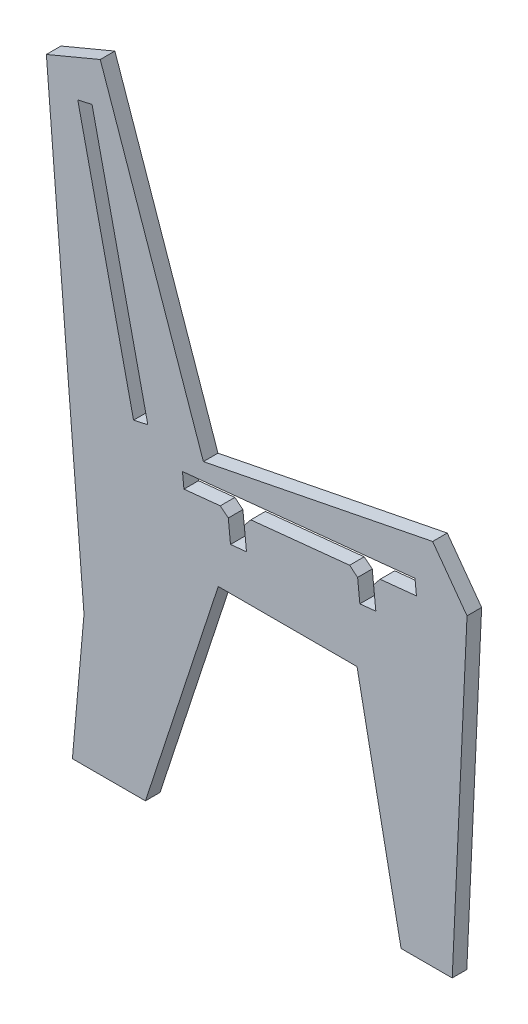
from build123d import *

# Parameters (mm, degrees)
BOSS_EXTRU_1_DEPTH      = 20
ENL_V_MAT_EXTRU_1_REACH = 1007.791
CHANFREIN1_SIZE         = 10


with BuildPart() as part:
    # Esquisse1 → Boss.-Extru.1 (new body)
    with BuildSketch(Plane.XY):
        Polygon((0, 0), (100, 0), (199.6875, 304.076310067), (389.6875, 304.076310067), (450, 0), (520, 0), (540.29235972, 439.531819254), (493.205697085, 504.206746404), (179.32047379, 441.948681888), (38.150818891, 848.115062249), (-35.64280505, 817.220061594), (15.884775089, 179.297724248), align=None)
        Polygon((26.871621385, 789.187602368), (103.241365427, 447.621119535), (83.723280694, 443.257134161), (7.353536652, 784.823616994), align=None, mode=Mode.SUBTRACT)
        Polygon((150.677202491, 415.877767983), (469.016696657, 448.434893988), (471.051517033, 428.538675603), (152.712022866, 395.981549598), align=None, mode=Mode.SUBTRACT)
    extrude(amount=BOSS_EXTRU_1_DEPTH)

    # Esquisse2 → Enl_v. mat.-Extru.1 (cut, up to next)
    with BuildSketch(Plane.XY.offset(20), mode=Mode.PRIVATE) as enl_v_mat_extru_1_sk1:
        Polygon((212.400678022, 402.086010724), (234.286518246, 404.324313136), (238.356158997, 364.531876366), (216.470318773, 362.293573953), align=None)
    enl_v_mat_extru_1_tool1 = extrude(enl_v_mat_extru_1_sk1.sketch, amount=-ENL_V_MAT_EXTRU_1_REACH, mode=Mode.PRIVATE) & part.part
    # Esquisse2 → Enl_v. mat.-Extru.1 (cut, up to next)
    with BuildSketch(Plane.XY.offset(20), mode=Mode.PRIVATE) as enl_v_mat_extru_1_sk2:
        Polygon((389.477021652, 420.195912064), (411.362861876, 422.434214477), (415.432502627, 382.641777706), (393.546662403, 380.403475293), align=None)
    enl_v_mat_extru_1_tool2 = extrude(enl_v_mat_extru_1_sk2.sketch, amount=-ENL_V_MAT_EXTRU_1_REACH, mode=Mode.PRIVATE) & part.part
    add(enl_v_mat_extru_1_tool1.solids().sort_by_distance((225.378419, 383.308944, 20))[0], mode=Mode.SUBTRACT)
    add(enl_v_mat_extru_1_tool2.solids().sort_by_distance((402.454762, 401.418845, 20))[0], mode=Mode.SUBTRACT)

    # Chanfrein1
    chanfrein1_edges = [part.edges().sort_by_distance(p)[0] for p in [
        (212.400678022, 402.086010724, 10),
        (234.286518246, 404.324313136, 10),
        (389.477021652, 420.195912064, 10),
        (411.362861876, 422.434214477, 10),
    ]]
    chamfer(chanfrein1_edges, length=CHANFREIN1_SIZE)


solid = part.part
